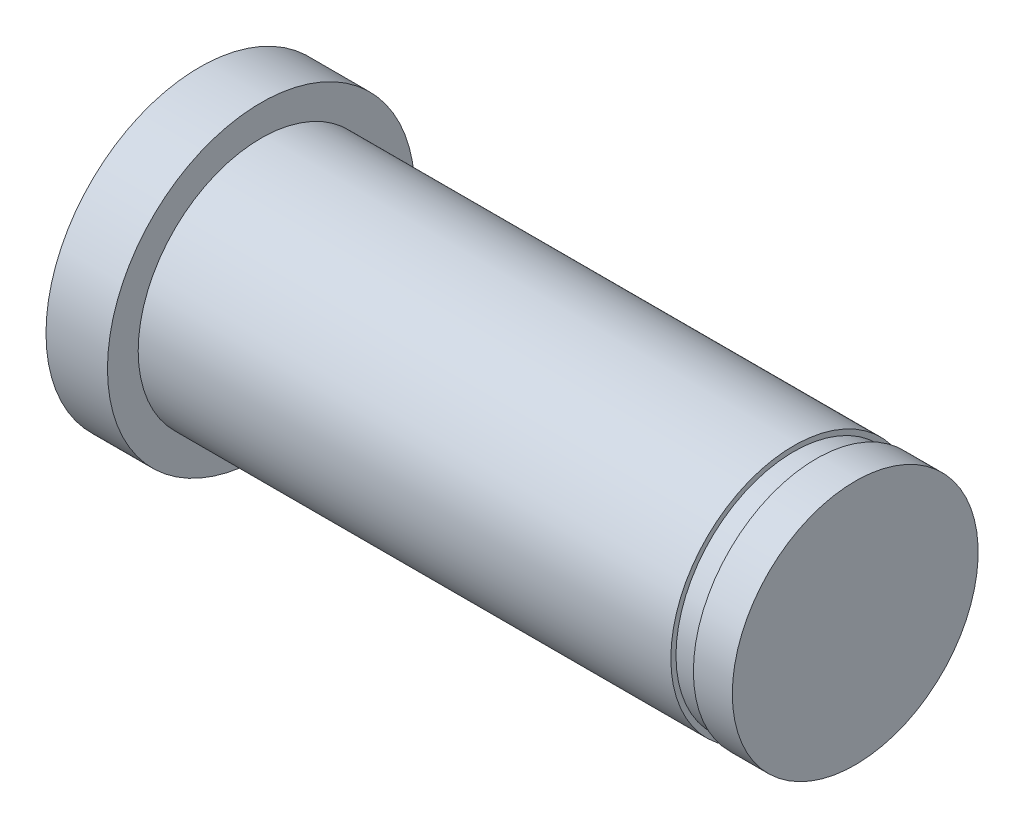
from build123d import *


with BuildPart() as part:
    # Esquisse1 → Base-R_volution (revolve)
    with BuildSketch(Plane.XY, mode=Mode.PRIVATE) as base_r_volution_sk:
        Polygon((0, 0), (0, 7.5), (3, 7.5), (3, 6), (29, 6), (29, 5.75), (30.1, 5.75), (30.1, 6), (32, 6), (32, 0), align=None)
    revolve(base_r_volution_sk.sketch.rotate(Axis((0, 0, 0), (1, 0, 0)), 90), axis=Axis((0, 0, 0), (1, 0, 0)))


solid = part.part
